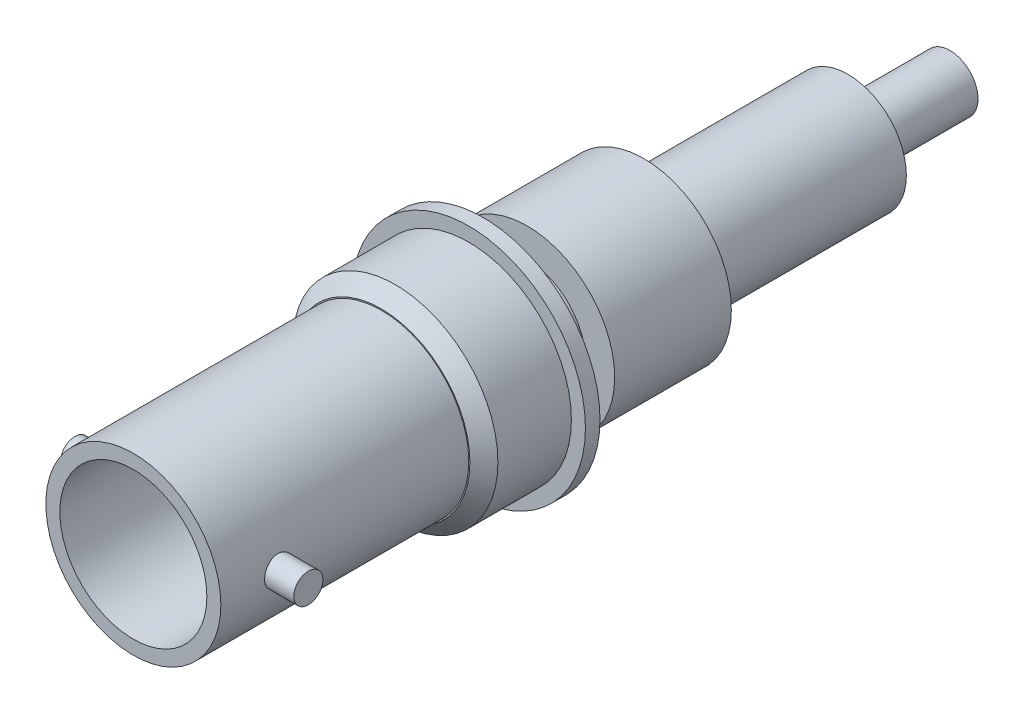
ISO-10303-21;
HEADER;
FILE_DESCRIPTION(('STEP AP214'),'2;1');
FILE_NAME('part.step','',(''),(''),'','','');
FILE_SCHEMA(('AUTOMOTIVE_DESIGN { 1 0 10303 214 1 1 1 1 }'));
ENDSEC;
DATA;
#1=APPLICATION_CONTEXT('core data for automotive mechanical design processes');
#2=APPLICATION_PROTOCOL_DEFINITION('international standard','automotive_design',2000,#1);
#3=PRODUCT_CONTEXT('',#1,'mechanical');
#4=PRODUCT('Part','Part','',(#3));
#5=PRODUCT_RELATED_PRODUCT_CATEGORY('part','',(#4));
#6=PRODUCT_DEFINITION_FORMATION('','',#4);
#7=PRODUCT_DEFINITION_CONTEXT('part definition',#1,'design');
#8=PRODUCT_DEFINITION('design','',#6,#7);
#9=PRODUCT_DEFINITION_SHAPE('','',#8);
#10=(LENGTH_UNIT() NAMED_UNIT(*) SI_UNIT(.MILLI.,.METRE.));
#11=(NAMED_UNIT(*) PLANE_ANGLE_UNIT() SI_UNIT($,.RADIAN.));
#12=(NAMED_UNIT(*) SI_UNIT($,.STERADIAN.) SOLID_ANGLE_UNIT());
#13=UNCERTAINTY_MEASURE_WITH_UNIT(LENGTH_MEASURE(1.E-05),#10,'distance_accuracy_value','');
#14=(GEOMETRIC_REPRESENTATION_CONTEXT(3) GLOBAL_UNCERTAINTY_ASSIGNED_CONTEXT((#13)) GLOBAL_UNIT_ASSIGNED_CONTEXT((#10,
#11,#12)) REPRESENTATION_CONTEXT('',''));
#15=CARTESIAN_POINT('',(0.,0.,0.));
#16=DIRECTION('',(0.,0.,1.));
#17=DIRECTION('',(1.,0.,0.));
#18=AXIS2_PLACEMENT_3D('',#15,#16,#17);
#19=CARTESIAN_POINT('',(0.,0.,0.79375000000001));
#20=DIRECTION('',(0.,0.,1.));
#21=DIRECTION('',(1.00000000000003,0.,0.));
#22=AXIS2_PLACEMENT_3D('',#19,#20,#21);
#23=PLANE('',#22);
#24=CARTESIAN_POINT('',(0.,0.,0.79375000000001));
#25=DIRECTION('',(0.,0.,1.));
#26=DIRECTION('',(1.00000000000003,0.,0.));
#27=AXIS2_PLACEMENT_3D('',#24,#25,#26);
#28=CIRCLE('',#27,6.35);
#29=CARTESIAN_POINT('',(6.35000000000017,0.,0.79375000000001));
#30=VERTEX_POINT('',#29);
#31=EDGE_CURVE('E54',#30,#30,#28,.T.);
#32=ORIENTED_EDGE('',*,*,#31,.T.);
#33=EDGE_LOOP('',(#32));
#34=FACE_BOUND('',#33,.T.);
#35=CARTESIAN_POINT('',(0.,0.,0.79375000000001));
#36=DIRECTION('',(0.,0.,1.));
#37=DIRECTION('',(1.00000000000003,0.,0.));
#38=AXIS2_PLACEMENT_3D('',#35,#36,#37);
#39=CIRCLE('',#38,5.588);
#40=CARTESIAN_POINT('',(-5.58800000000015,0.,0.793750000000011));
#41=VERTEX_POINT('',#40);
#42=EDGE_CURVE('E113',#41,#41,#39,.T.);
#43=ORIENTED_EDGE('',*,*,#42,.F.);
#44=EDGE_LOOP('',(#43));
#45=FACE_BOUND('',#44,.T.);
#46=ADVANCED_FACE('F36',(#34,#45),#23,.T.);
#47=CARTESIAN_POINT('',(0.,0.,19.05));
#48=DIRECTION('',(0.,0.,-1.));
#49=DIRECTION('',(-1.00000000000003,0.,0.));
#50=AXIS2_PLACEMENT_3D('',#47,#48,#49);
#51=CYLINDRICAL_SURFACE('',#50,4.7625);
#52=CARTESIAN_POINT('',(0.,0.,5.55625000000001));
#53=DIRECTION('',(0.,0.,1.));
#54=DIRECTION('',(1.00000000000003,0.,0.));
#55=AXIS2_PLACEMENT_3D('',#52,#53,#54);
#56=CIRCLE('',#55,4.7625);
#57=CARTESIAN_POINT('',(4.76250000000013,0.,5.55625000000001));
#58=VERTEX_POINT('',#57);
#59=EDGE_CURVE('E115',#58,#58,#56,.T.);
#60=ORIENTED_EDGE('',*,*,#59,.T.);
#61=EDGE_LOOP('',(#60));
#62=FACE_BOUND('',#61,.T.);
#63=CARTESIAN_POINT('',(4.7625000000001,0.,16.66875));
#64=CARTESIAN_POINT('',(4.76249924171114,-0.0442566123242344,16.668748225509));
#65=CARTESIAN_POINT('',(4.7618766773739,-0.088537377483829,16.6650361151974));
#66=CARTESIAN_POINT('',(4.75945309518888,-0.175856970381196,16.650291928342));
#67=CARTESIAN_POINT('',(4.7576509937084,-0.218894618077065,16.6392531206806));
#68=CARTESIAN_POINT('',(4.75307046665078,-0.302452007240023,16.6101980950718));
#69=CARTESIAN_POINT('',(4.75029283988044,-0.342973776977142,16.5921875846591));
#70=CARTESIAN_POINT('',(4.74406667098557,-0.420415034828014,16.5497153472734));
#71=CARTESIAN_POINT('',(4.74061820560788,-0.457334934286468,16.5252543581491));
#72=CARTESIAN_POINT('',(4.73339578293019,-0.52688255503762,16.470326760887));
#73=CARTESIAN_POINT('',(4.72961929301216,-0.559470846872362,16.439810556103));
#74=CARTESIAN_POINT('',(4.72218584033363,-0.619089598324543,16.3737455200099));
#75=CARTESIAN_POINT('',(4.71852888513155,-0.646119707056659,16.3381963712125));
#76=CARTESIAN_POINT('',(4.71172402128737,-0.694012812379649,16.2628037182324));
#77=CARTESIAN_POINT('',(4.70857938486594,-0.714836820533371,16.2229351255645));
#78=CARTESIAN_POINT('',(4.7031903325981,-0.749477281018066,16.1402047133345));
#79=CARTESIAN_POINT('',(4.70094585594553,-0.763294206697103,16.0973430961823));
#80=CARTESIAN_POINT('',(4.69763645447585,-0.783404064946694,16.010261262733));
#81=CARTESIAN_POINT('',(4.69656086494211,-0.789765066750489,15.9660571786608));
#82=CARTESIAN_POINT('',(4.69567875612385,-0.794993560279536,15.8771970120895));
#83=CARTESIAN_POINT('',(4.69587214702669,-0.793861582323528,15.8325409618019));
#84=CARTESIAN_POINT('',(4.69749641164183,-0.784191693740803,15.7445304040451));
#85=CARTESIAN_POINT('',(4.69891450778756,-0.775730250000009,15.7011672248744));
#86=CARTESIAN_POINT('',(4.70280839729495,-0.751761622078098,15.6164847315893));
#87=CARTESIAN_POINT('',(4.7052842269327,-0.73625419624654,15.5751654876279));
#88=CARTESIAN_POINT('',(4.71102842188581,-0.698556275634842,15.4955148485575));
#89=CARTESIAN_POINT('',(4.71430053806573,-0.676334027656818,15.4571987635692));
#90=CARTESIAN_POINT('',(4.72126601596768,-0.625859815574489,15.3848103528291));
#91=CARTESIAN_POINT('',(4.72495941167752,-0.597607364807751,15.3507383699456));
#92=CARTESIAN_POINT('',(4.73240743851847,-0.535458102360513,15.2873627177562));
#93=CARTESIAN_POINT('',(4.73616226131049,-0.50149568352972,15.2581233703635));
#94=CARTESIAN_POINT('',(4.7432677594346,-0.429112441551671,15.2057488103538));
#95=CARTESIAN_POINT('',(4.7466184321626,-0.390691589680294,15.1826136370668));
#96=CARTESIAN_POINT('',(4.75254285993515,-0.310421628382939,15.1430982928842));
#97=CARTESIAN_POINT('',(4.75511596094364,-0.268569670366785,15.1267238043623));
#98=CARTESIAN_POINT('',(4.75919007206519,-0.182657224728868,15.1012543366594));
#99=CARTESIAN_POINT('',(4.76069117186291,-0.138596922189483,15.0921587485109));
#100=CARTESIAN_POINT('',(4.76244008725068,-0.050072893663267,15.0815924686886));
#101=CARTESIAN_POINT('',(4.76270241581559,-0.00561998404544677,15.0800334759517));
#102=CARTESIAN_POINT('',(4.76198398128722,0.0829118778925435,15.0843492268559));
#103=CARTESIAN_POINT('',(4.76100326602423,0.126990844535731,15.0902236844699));
#104=CARTESIAN_POINT('',(4.75791792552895,0.213250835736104,15.109166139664));
#105=CARTESIAN_POINT('',(4.75582013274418,0.255441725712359,15.1221904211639));
#106=CARTESIAN_POINT('',(4.75073492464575,0.337041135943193,15.1550162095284));
#107=CARTESIAN_POINT('',(4.74774745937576,0.376449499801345,15.1748180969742));
#108=CARTESIAN_POINT('',(4.74117833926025,0.451748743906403,15.2208392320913));
#109=CARTESIAN_POINT('',(4.73759166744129,0.487605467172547,15.2471136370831));
#110=CARTESIAN_POINT('',(4.73023713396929,0.554432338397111,15.3052580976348));
#111=CARTESIAN_POINT('',(4.72646925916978,0.585402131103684,15.3371285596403));
#112=CARTESIAN_POINT('',(4.71913005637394,0.641903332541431,15.4059564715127));
#113=CARTESIAN_POINT('',(4.71556116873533,0.667375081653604,15.4429631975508));
#114=CARTESIAN_POINT('',(4.70906960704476,0.711740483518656,15.5207820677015));
#115=CARTESIAN_POINT('',(4.70614691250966,0.73063434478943,15.5615940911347));
#116=CARTESIAN_POINT('',(4.70129696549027,0.761218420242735,15.6456982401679));
#117=CARTESIAN_POINT('',(4.69936561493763,0.772938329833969,15.6889793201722));
#118=CARTESIAN_POINT('',(4.69670675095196,0.788935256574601,15.7769306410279));
#119=CARTESIAN_POINT('',(4.69597913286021,0.79321292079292,15.8216007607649));
#120=CARTESIAN_POINT('',(4.69581462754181,0.794185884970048,15.910466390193));
#121=CARTESIAN_POINT('',(4.69636175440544,0.790975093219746,15.9546608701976));
#122=CARTESIAN_POINT('',(4.69865005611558,0.777265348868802,16.0418714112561));
#123=CARTESIAN_POINT('',(4.70039122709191,0.766766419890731,16.084887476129));
#124=CARTESIAN_POINT('',(4.70486535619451,0.738814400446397,16.1684838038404));
#125=CARTESIAN_POINT('',(4.70759716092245,0.721369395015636,16.2090668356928));
#126=CARTESIAN_POINT('',(4.71374587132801,0.680030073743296,16.2867453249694));
#127=CARTESIAN_POINT('',(4.71716281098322,0.656135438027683,16.3238406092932));
#128=CARTESIAN_POINT('',(4.7243474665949,0.602239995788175,16.3939650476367));
#129=CARTESIAN_POINT('',(4.72811886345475,0.572170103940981,16.4269407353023));
#130=CARTESIAN_POINT('',(4.73555813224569,0.506923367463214,16.4874103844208));
#131=CARTESIAN_POINT('',(4.73922598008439,0.471745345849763,16.5149030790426));
#132=CARTESIAN_POINT('',(4.74607423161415,0.396992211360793,16.5637998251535));
#133=CARTESIAN_POINT('',(4.7492510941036,0.357388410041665,16.5851605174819));
#134=CARTESIAN_POINT('',(4.75472495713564,0.275117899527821,16.6208930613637));
#135=CARTESIAN_POINT('',(4.75702283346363,0.232454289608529,16.6352718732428));
#136=CARTESIAN_POINT('',(4.75997838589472,0.158020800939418,16.6535116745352));
#137=CARTESIAN_POINT('',(4.76091893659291,0.126701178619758,16.6592168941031));
#138=CARTESIAN_POINT('',(4.76218001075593,0.0635918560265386,16.6668366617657));
#139=CARTESIAN_POINT('',(4.76250054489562,0.0318021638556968,16.6687512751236));
#140=CARTESIAN_POINT('',(4.7625000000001,0.,16.66875));
#141=B_SPLINE_CURVE_WITH_KNOTS('',3,(#63,#64,#65,#66,#67,#68,#69,#70,#71,#72,#73,#74,#75,#76,
#77,#78,#79,#80,#81,#82,#83,#84,#85,#86,#87,#88,#89,#90,#91,#92,#93,#94,#95,#96,#97,#98,#99,
#100,#101,#102,#103,#104,#105,#106,#107,#108,#109,#110,#111,#112,#113,#114,#115,#116,#117,#118,
#119,#120,#121,#122,#123,#124,#125,#126,#127,#128,#129,#130,#131,#132,#133,#134,#135,#136,#137,
#138,#139,#140),.UNSPECIFIED.,.T.,.F.,(4,2,2,2,2,2,2,2,2,2,2,2,2,2,2,2,2,2,2,2,2,2,2,2,2,2,2,2,
2,2,2,2,2,2,2,2,2,2,4),(0.,0.132653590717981,0.265429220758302,0.398096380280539,
0.530748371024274,0.664535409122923,0.798330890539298,0.932950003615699,1.06756002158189,
1.20093129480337,1.3342931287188,1.46628015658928,1.59827171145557,1.73089746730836,
1.86353393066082,1.99781404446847,2.13209502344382,2.26648863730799,2.40087100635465,
2.53367503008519,2.66647394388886,2.79846978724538,2.93047304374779,3.06364267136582,
3.19682197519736,3.3313808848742,3.46593552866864,3.59992937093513,3.7339115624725,
3.86622261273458,3.99853323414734,4.13069029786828,4.26285391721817,4.39658564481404,
4.53034823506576,4.66503458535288,4.799586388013,4.89491098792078,4.99023394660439),.UNSPECIFIED.);
#142=CARTESIAN_POINT('',(4.7625000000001,0.,16.66875));
#143=VERTEX_POINT('',#142);
#144=EDGE_CURVE('E51',#143,#143,#141,.T.);
#145=ORIENTED_EDGE('',*,*,#144,.F.);
#146=EDGE_LOOP('',(#145));
#147=FACE_BOUND('',#146,.T.);
#148=CARTESIAN_POINT('',(0.,0.,19.05));
#149=DIRECTION('',(0.,0.,1.));
#150=DIRECTION('',(1.00000000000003,0.,0.));
#151=AXIS2_PLACEMENT_3D('',#148,#149,#150);
#152=CIRCLE('',#151,4.7625);
#153=CARTESIAN_POINT('',(4.76250000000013,0.,19.05));
#154=VERTEX_POINT('',#153);
#155=EDGE_CURVE('E60',#154,#154,#152,.T.);
#156=ORIENTED_EDGE('',*,*,#155,.F.);
#157=EDGE_LOOP('',(#156));
#158=FACE_BOUND('',#157,.T.);
#159=CARTESIAN_POINT('',(-4.76250000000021,0.,16.66875));
#160=CARTESIAN_POINT('',(-4.76249924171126,0.0442566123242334,16.668748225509));
#161=CARTESIAN_POINT('',(-4.76187667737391,0.0885373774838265,16.6650361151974));
#162=CARTESIAN_POINT('',(-4.75945309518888,0.175856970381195,16.650291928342));
#163=CARTESIAN_POINT('',(-4.7576509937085,0.218894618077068,16.6392531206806));
#164=CARTESIAN_POINT('',(-4.75307046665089,0.302452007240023,16.6101980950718));
#165=CARTESIAN_POINT('',(-4.75029283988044,0.342973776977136,16.5921875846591));
#166=CARTESIAN_POINT('',(-4.74406667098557,0.420415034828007,16.5497153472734));
#167=CARTESIAN_POINT('',(-4.74061820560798,0.457334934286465,16.5252543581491));
#168=CARTESIAN_POINT('',(-4.7333957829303,0.526882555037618,16.470326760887));
#169=CARTESIAN_POINT('',(-4.72961929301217,0.559470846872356,16.439810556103));
#170=CARTESIAN_POINT('',(-4.72218584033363,0.619089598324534,16.3737455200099));
#171=CARTESIAN_POINT('',(-4.71852888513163,0.646119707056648,16.3381963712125));
#172=CARTESIAN_POINT('',(-4.71172402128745,0.694012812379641,16.2628037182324));
#173=CARTESIAN_POINT('',(-4.70857938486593,0.714836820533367,16.2229351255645));
#174=CARTESIAN_POINT('',(-4.70319033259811,0.749477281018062,16.1402047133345));
#175=CARTESIAN_POINT('',(-4.70094585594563,0.763294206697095,16.0973430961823));
#176=CARTESIAN_POINT('',(-4.69763645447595,0.783404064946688,16.010261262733));
#177=CARTESIAN_POINT('',(-4.69656086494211,0.789765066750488,15.9660571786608));
#178=CARTESIAN_POINT('',(-4.69567875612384,0.794993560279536,15.8771970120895));
#179=CARTESIAN_POINT('',(-4.69587214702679,0.793861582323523,15.8325409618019));
#180=CARTESIAN_POINT('',(-4.69749641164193,0.784191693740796,15.7445304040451));
#181=CARTESIAN_POINT('',(-4.69891450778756,0.775730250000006,15.7011672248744));
#182=CARTESIAN_POINT('',(-4.70280839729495,0.751761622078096,15.6164847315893));
#183=CARTESIAN_POINT('',(-4.70528422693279,0.736254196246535,15.5751654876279));
#184=CARTESIAN_POINT('',(-4.71102842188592,0.698556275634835,15.4955148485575));
#185=CARTESIAN_POINT('',(-4.71430053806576,0.676334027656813,15.4571987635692));
#186=CARTESIAN_POINT('',(-4.72126601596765,0.625859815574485,15.3848103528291));
#187=CARTESIAN_POINT('',(-4.72495941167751,0.597607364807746,15.3507383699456));
#188=CARTESIAN_POINT('',(-4.73240743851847,0.53545810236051,15.2873627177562));
#189=CARTESIAN_POINT('',(-4.73616226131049,0.501495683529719,15.2581233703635));
#190=CARTESIAN_POINT('',(-4.7432677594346,0.429112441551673,15.2057488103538));
#191=CARTESIAN_POINT('',(-4.7466184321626,0.390691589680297,15.1826136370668));
#192=CARTESIAN_POINT('',(-4.75254285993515,0.310421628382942,15.1430982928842));
#193=CARTESIAN_POINT('',(-4.75511596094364,0.268569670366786,15.1267238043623));
#194=CARTESIAN_POINT('',(-4.75919007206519,0.182657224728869,15.1012543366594));
#195=CARTESIAN_POINT('',(-4.76069117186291,0.138596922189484,15.0921587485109));
#196=CARTESIAN_POINT('',(-4.76244008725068,0.050072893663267,15.0815924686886));
#197=CARTESIAN_POINT('',(-4.76270241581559,0.00561998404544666,15.0800334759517));
#198=CARTESIAN_POINT('',(-4.76198398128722,-0.0829118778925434,15.0843492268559));
#199=CARTESIAN_POINT('',(-4.76100326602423,-0.12699084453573,15.0902236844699));
#200=CARTESIAN_POINT('',(-4.75791792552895,-0.213250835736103,15.109166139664));
#201=CARTESIAN_POINT('',(-4.75582013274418,-0.255441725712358,15.1221904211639));
#202=CARTESIAN_POINT('',(-4.75073492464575,-0.337041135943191,15.1550162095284));
#203=CARTESIAN_POINT('',(-4.74774745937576,-0.376449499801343,15.1748180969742));
#204=CARTESIAN_POINT('',(-4.74117833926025,-0.451748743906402,15.2208392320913));
#205=CARTESIAN_POINT('',(-4.73759166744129,-0.487605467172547,15.2471136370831));
#206=CARTESIAN_POINT('',(-4.73023713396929,-0.554432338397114,15.3052580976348));
#207=CARTESIAN_POINT('',(-4.72646925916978,-0.585402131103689,15.3371285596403));
#208=CARTESIAN_POINT('',(-4.71913005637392,-0.641903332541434,15.4059564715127));
#209=CARTESIAN_POINT('',(-4.7155611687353,-0.667375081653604,15.4429631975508));
#210=CARTESIAN_POINT('',(-4.70906960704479,-0.711740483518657,15.5207820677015));
#211=CARTESIAN_POINT('',(-4.70614691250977,-0.730634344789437,15.5615940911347));
#212=CARTESIAN_POINT('',(-4.70129696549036,-0.761218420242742,15.6456982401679));
#213=CARTESIAN_POINT('',(-4.69936561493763,-0.772938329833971,15.6889793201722));
#214=CARTESIAN_POINT('',(-4.69670675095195,-0.788935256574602,15.7769306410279));
#215=CARTESIAN_POINT('',(-4.69597913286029,-0.793212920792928,15.8216007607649));
#216=CARTESIAN_POINT('',(-4.69581462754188,-0.794185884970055,15.910466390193));
#217=CARTESIAN_POINT('',(-4.69636175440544,-0.790975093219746,15.9546608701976));
#218=CARTESIAN_POINT('',(-4.69865005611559,-0.777265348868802,16.0418714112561));
#219=CARTESIAN_POINT('',(-4.70039122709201,-0.766766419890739,16.084887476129));
#220=CARTESIAN_POINT('',(-4.70486535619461,-0.738814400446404,16.1684838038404));
#221=CARTESIAN_POINT('',(-4.70759716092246,-0.721369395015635,16.2090668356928));
#222=CARTESIAN_POINT('',(-4.71374587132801,-0.680030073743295,16.2867453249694));
#223=CARTESIAN_POINT('',(-4.71716281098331,-0.656135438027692,16.3238406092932));
#224=CARTESIAN_POINT('',(-4.72434746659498,-0.602239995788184,16.3939650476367));
#225=CARTESIAN_POINT('',(-4.72811886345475,-0.57217010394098,16.4269407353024));
#226=CARTESIAN_POINT('',(-4.73555813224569,-0.50692336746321,16.4874103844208));
#227=CARTESIAN_POINT('',(-4.73922598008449,-0.471745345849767,16.5149030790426));
#228=CARTESIAN_POINT('',(-4.74607423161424,-0.396992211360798,16.5637998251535));
#229=CARTESIAN_POINT('',(-4.74925109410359,-0.357388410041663,16.5851605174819));
#230=CARTESIAN_POINT('',(-4.75472495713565,-0.275117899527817,16.6208930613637));
#231=CARTESIAN_POINT('',(-4.75702283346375,-0.23245428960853,16.6352718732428));
#232=CARTESIAN_POINT('',(-4.75997838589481,-0.158020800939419,16.6535116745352));
#233=CARTESIAN_POINT('',(-4.76091893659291,-0.126701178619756,16.6592168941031));
#234=CARTESIAN_POINT('',(-4.76218001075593,-0.063591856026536,16.6668366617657));
#235=CARTESIAN_POINT('',(-4.76250054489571,-0.0318021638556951,16.6687512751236));
#236=CARTESIAN_POINT('',(-4.76250000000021,0.,16.66875));
#237=B_SPLINE_CURVE_WITH_KNOTS('',3,(#159,#160,#161,#162,#163,#164,#165,#166,#167,#168,#169,
#170,#171,#172,#173,#174,#175,#176,#177,#178,#179,#180,#181,#182,#183,#184,#185,#186,#187,#188,
#189,#190,#191,#192,#193,#194,#195,#196,#197,#198,#199,#200,#201,#202,#203,#204,#205,#206,#207,
#208,#209,#210,#211,#212,#213,#214,#215,#216,#217,#218,#219,#220,#221,#222,#223,#224,#225,#226,
#227,#228,#229,#230,#231,#232,#233,#234,#235,#236),.UNSPECIFIED.,.T.,.F.,(4,2,2,2,2,2,2,2,2,2,2,
2,2,2,2,2,2,2,2,2,2,2,2,2,2,2,2,2,2,2,2,2,2,2,2,2,2,2,4),(0.,0.13265359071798,0.2654292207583,
0.398096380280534,0.530748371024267,0.664535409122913,0.79833089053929,0.932950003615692,
1.06756002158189,1.20093129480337,1.33429312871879,1.46628015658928,1.59827171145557,
1.73089746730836,1.86353393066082,1.99781404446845,2.13209502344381,2.26648863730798,
2.40087100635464,2.53367503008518,2.66647394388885,2.79846978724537,2.93047304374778,
3.06364267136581,3.19682197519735,3.33138088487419,3.46593552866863,3.59992937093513,
3.73391156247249,3.86622261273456,3.99853323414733,4.13069029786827,4.26285391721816,
4.39658564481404,4.53034823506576,4.66503458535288,4.799586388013,4.89491098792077,
4.99023394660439),.UNSPECIFIED.);
#238=CARTESIAN_POINT('',(-4.76250000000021,0.,16.66875));
#239=VERTEX_POINT('',#238);
#240=EDGE_CURVE('E47',#239,#239,#237,.T.);
#241=ORIENTED_EDGE('',*,*,#240,.F.);
#242=EDGE_LOOP('',(#241));
#243=FACE_BOUND('',#242,.T.);
#244=ADVANCED_FACE('F74',(#62,#147,#158,#243),#51,.T.);
#245=CARTESIAN_POINT('',(0.,0.,19.05));
#246=DIRECTION('',(0.,0.,-1.));
#247=DIRECTION('',(-1.00000000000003,0.,0.));
#248=AXIS2_PLACEMENT_3D('',#245,#246,#247);
#249=CYLINDRICAL_SURFACE('',#248,4.0005);
#250=CARTESIAN_POINT('',(0.,0.,19.05));
#251=DIRECTION('',(0.,0.,1.));
#252=DIRECTION('',(1.00000000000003,0.,0.));
#253=AXIS2_PLACEMENT_3D('',#250,#251,#252);
#254=CIRCLE('',#253,4.0005);
#255=CARTESIAN_POINT('',(4.00050000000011,0.,19.05));
#256=VERTEX_POINT('',#255);
#257=EDGE_CURVE('E63',#256,#256,#254,.T.);
#258=ORIENTED_EDGE('',*,*,#257,.T.);
#259=EDGE_LOOP('',(#258));
#260=FACE_BOUND('',#259,.T.);
#261=CARTESIAN_POINT('',(0.,0.,0.));
#262=DIRECTION('',(0.,0.,1.));
#263=DIRECTION('',(1.00000000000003,0.,0.));
#264=AXIS2_PLACEMENT_3D('',#261,#262,#263);
#265=CIRCLE('',#264,4.0005);
#266=CARTESIAN_POINT('',(4.00050000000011,0.,0.));
#267=VERTEX_POINT('',#266);
#268=EDGE_CURVE('E119',#267,#267,#265,.T.);
#269=ORIENTED_EDGE('',*,*,#268,.F.);
#270=EDGE_LOOP('',(#269));
#271=FACE_BOUND('',#270,.T.);
#272=ADVANCED_FACE('F88',(#260,#271),#249,.F.);
#273=CARTESIAN_POINT('',(0.,0.,0.79375000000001));
#274=DIRECTION('',(0.,0.,-1.));
#275=DIRECTION('',(-1.00000000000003,0.,0.));
#276=AXIS2_PLACEMENT_3D('',#273,#274,#275);
#277=CYLINDRICAL_SURFACE('',#276,6.35);
#278=ORIENTED_EDGE('',*,*,#31,.F.);
#279=EDGE_LOOP('',(#278));
#280=FACE_BOUND('',#279,.T.);
#281=CARTESIAN_POINT('',(0.,0.,0.));
#282=DIRECTION('',(0.,0.,1.));
#283=DIRECTION('',(1.00000000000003,0.,0.));
#284=AXIS2_PLACEMENT_3D('',#281,#282,#283);
#285=CIRCLE('',#284,6.35);
#286=CARTESIAN_POINT('',(6.35000000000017,0.,0.));
#287=VERTEX_POINT('',#286);
#288=EDGE_CURVE('E57',#287,#287,#285,.T.);
#289=ORIENTED_EDGE('',*,*,#288,.T.);
#290=EDGE_LOOP('',(#289));
#291=FACE_BOUND('',#290,.T.);
#292=ADVANCED_FACE('F38',(#280,#291),#277,.T.);
#293=CARTESIAN_POINT('',(0.,0.,0.));
#294=DIRECTION('',(0.,0.,1.));
#295=DIRECTION('',(1.00000000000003,0.,0.));
#296=AXIS2_PLACEMENT_3D('',#293,#294,#295);
#297=PLANE('',#296);
#298=CARTESIAN_POINT('',(0.,0.,0.));
#299=DIRECTION('',(0.,0.,1.));
#300=DIRECTION('',(1.00000000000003,0.,0.));
#301=AXIS2_PLACEMENT_3D('',#298,#299,#300);
#302=CIRCLE('',#301,4.7625);
#303=CARTESIAN_POINT('',(4.76250000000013,0.,0.));
#304=VERTEX_POINT('',#303);
#305=EDGE_CURVE('E375',#304,#304,#302,.T.);
#306=ORIENTED_EDGE('',*,*,#305,.T.);
#307=EDGE_LOOP('',(#306));
#308=FACE_BOUND('',#307,.T.);
#309=ORIENTED_EDGE('',*,*,#288,.F.);
#310=EDGE_LOOP('',(#309));
#311=FACE_BOUND('',#310,.T.);
#312=ADVANCED_FACE('F94',(#308,#311),#297,.F.);
#313=CARTESIAN_POINT('',(0.,0.,19.05));
#314=DIRECTION('',(0.,0.,1.));
#315=DIRECTION('',(1.00000000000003,0.,0.));
#316=AXIS2_PLACEMENT_3D('',#313,#314,#315);
#317=PLANE('',#316);
#318=ORIENTED_EDGE('',*,*,#155,.T.);
#319=EDGE_LOOP('',(#318));
#320=FACE_BOUND('',#319,.T.);
#321=ORIENTED_EDGE('',*,*,#257,.F.);
#322=EDGE_LOOP('',(#321));
#323=FACE_BOUND('',#322,.T.);
#324=ADVANCED_FACE('F92',(#320,#323),#317,.T.);
#325=CARTESIAN_POINT('',(6.3500000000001,0.,15.875));
#326=DIRECTION('',(1.00000000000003,0.,0.));
#327=DIRECTION('',(0.,0.,-1.));
#328=AXIS2_PLACEMENT_3D('',#325,#326,#327);
#329=PLANE('',#328);
#330=CARTESIAN_POINT('',(6.3500000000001,0.,15.875));
#331=DIRECTION('',(1.00000000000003,0.,0.));
#332=DIRECTION('',(0.,0.,-1.));
#333=AXIS2_PLACEMENT_3D('',#330,#331,#332);
#334=CIRCLE('',#333,0.793749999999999);
#335=CARTESIAN_POINT('',(6.3500000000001,0.,15.08125));
#336=VERTEX_POINT('',#335);
#337=EDGE_CURVE('E65',#336,#336,#334,.T.);
#338=ORIENTED_EDGE('',*,*,#337,.T.);
#339=EDGE_LOOP('',(#338));
#340=FACE_BOUND('',#339,.T.);
#341=ADVANCED_FACE('F86',(#340),#329,.T.);
#342=CARTESIAN_POINT('',(6.3500000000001,0.,15.875));
#343=DIRECTION('',(-1.00000000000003,0.,0.));
#344=DIRECTION('',(0.,0.,1.));
#345=AXIS2_PLACEMENT_3D('',#342,#343,#344);
#346=CYLINDRICAL_SURFACE('',#345,0.793749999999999);
#347=ORIENTED_EDGE('',*,*,#337,.F.);
#348=EDGE_LOOP('',(#347));
#349=FACE_BOUND('',#348,.T.);
#350=ORIENTED_EDGE('',*,*,#144,.T.);
#351=EDGE_LOOP('',(#350));
#352=FACE_BOUND('',#351,.T.);
#353=ADVANCED_FACE('F84',(#349,#352),#346,.T.);
#354=CARTESIAN_POINT('',(-6.35000000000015,0.,15.875));
#355=DIRECTION('',(1.00000000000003,0.,0.));
#356=DIRECTION('',(0.,0.,-1.));
#357=AXIS2_PLACEMENT_3D('',#354,#355,#356);
#358=CIRCLE('',#357,0.793749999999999);
#359=CARTESIAN_POINT('',(-6.35000000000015,0.,15.08125));
#360=VERTEX_POINT('',#359);
#361=EDGE_CURVE('E128',#360,#360,#358,.T.);
#362=ORIENTED_EDGE('',*,*,#361,.T.);
#363=EDGE_LOOP('',(#362));
#364=FACE_BOUND('',#363,.T.);
#365=ORIENTED_EDGE('',*,*,#240,.T.);
#366=EDGE_LOOP('',(#365));
#367=FACE_BOUND('',#366,.T.);
#368=ADVANCED_FACE('F78',(#364,#367),#346,.T.);
#369=CARTESIAN_POINT('',(-6.35000000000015,0.,15.875));
#370=DIRECTION('',(1.00000000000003,0.,0.));
#371=DIRECTION('',(0.,0.,-1.));
#372=AXIS2_PLACEMENT_3D('',#369,#370,#371);
#373=PLANE('',#372);
#374=ORIENTED_EDGE('',*,*,#361,.F.);
#375=EDGE_LOOP('',(#374));
#376=FACE_BOUND('',#375,.T.);
#377=ADVANCED_FACE('F83',(#376),#373,.F.);
#378=CARTESIAN_POINT('',(0.,0.,5.55625000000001));
#379=DIRECTION('',(0.,0.,1.));
#380=DIRECTION('',(1.00000000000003,0.,0.));
#381=AXIS2_PLACEMENT_3D('',#378,#379,#380);
#382=PLANE('',#381);
#383=CARTESIAN_POINT('',(0.,0.,5.55625000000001));
#384=DIRECTION('',(0.,0.,1.));
#385=DIRECTION('',(1.00000000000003,0.,0.));
#386=AXIS2_PLACEMENT_3D('',#383,#384,#385);
#387=CIRCLE('',#386,4.82600000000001);
#388=CARTESIAN_POINT('',(4.82600000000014,0.,5.55625000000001));
#389=VERTEX_POINT('',#388);
#390=EDGE_CURVE('E43',#389,#389,#387,.T.);
#391=ORIENTED_EDGE('',*,*,#390,.T.);
#392=EDGE_LOOP('',(#391));
#393=FACE_BOUND('',#392,.T.);
#394=ORIENTED_EDGE('',*,*,#59,.F.);
#395=EDGE_LOOP('',(#394));
#396=FACE_BOUND('',#395,.T.);
#397=ADVANCED_FACE('F157',(#393,#396),#382,.T.);
#398=CARTESIAN_POINT('',(0.,0.,5.55625000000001));
#399=DIRECTION('',(0.,0.,-1.));
#400=DIRECTION('',(-1.00000000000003,0.,0.));
#401=AXIS2_PLACEMENT_3D('',#398,#399,#400);
#402=CYLINDRICAL_SURFACE('',#401,5.588);
#403=CARTESIAN_POINT('',(0.,0.,4.79425000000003));
#404=DIRECTION('',(0.,0.,1.));
#405=DIRECTION('',(1.00000000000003,0.,0.));
#406=AXIS2_PLACEMENT_3D('',#403,#404,#405);
#407=CIRCLE('',#406,5.588);
#408=CARTESIAN_POINT('',(-5.58800000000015,0.,4.79425000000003));
#409=VERTEX_POINT('',#408);
#410=EDGE_CURVE('E11',#409,#409,#407,.F.);
#411=CARTESIAN_POINT('',(-5.58800000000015,0.,4.79425000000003));
#412=CARTESIAN_POINT('',(-5.58800000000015,0.,4.75257812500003));
#413=CARTESIAN_POINT('',(-5.58800000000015,0.,4.71090625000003));
#414=CARTESIAN_POINT('',(-5.58800000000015,0.,4.62756250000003));
#415=CARTESIAN_POINT('',(-5.58800000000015,0.,4.58589062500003));
#416=CARTESIAN_POINT('',(-5.58800000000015,0.,4.50254687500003));
#417=CARTESIAN_POINT('',(-5.58800000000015,0.,4.46087500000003));
#418=CARTESIAN_POINT('',(-5.58800000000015,0.,4.37753125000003));
#419=CARTESIAN_POINT('',(-5.58800000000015,0.,4.33585937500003));
#420=CARTESIAN_POINT('',(-5.58800000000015,0.,4.25251562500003));
#421=CARTESIAN_POINT('',(-5.58800000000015,0.,4.21084375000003));
#422=CARTESIAN_POINT('',(-5.58800000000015,0.,4.12750000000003));
#423=CARTESIAN_POINT('',(-5.58800000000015,0.,4.08582812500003));
#424=CARTESIAN_POINT('',(-5.58800000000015,0.,4.00248437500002));
#425=CARTESIAN_POINT('',(-5.58800000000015,0.,3.96081250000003));
#426=CARTESIAN_POINT('',(-5.58800000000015,0.,3.87746875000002));
#427=CARTESIAN_POINT('',(-5.58800000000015,0.,3.83579687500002));
#428=CARTESIAN_POINT('',(-5.58800000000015,0.,3.75245312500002));
#429=CARTESIAN_POINT('',(-5.58800000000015,0.,3.71078125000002));
#430=CARTESIAN_POINT('',(-5.58800000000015,0.,3.62743750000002));
#431=CARTESIAN_POINT('',(-5.58800000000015,0.,3.58576562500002));
#432=CARTESIAN_POINT('',(-5.58800000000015,0.,3.50242187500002));
#433=CARTESIAN_POINT('',(-5.58800000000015,0.,3.46075000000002));
#434=CARTESIAN_POINT('',(-5.58800000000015,0.,3.37740625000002));
#435=CARTESIAN_POINT('',(-5.58800000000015,0.,3.33573437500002));
#436=CARTESIAN_POINT('',(-5.58800000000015,0.,3.25239062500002));
#437=CARTESIAN_POINT('',(-5.58800000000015,0.,3.21071875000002));
#438=CARTESIAN_POINT('',(-5.58800000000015,0.,3.12737500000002));
#439=CARTESIAN_POINT('',(-5.58800000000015,0.,3.08570312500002));
#440=CARTESIAN_POINT('',(-5.58800000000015,0.,3.00235937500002));
#441=CARTESIAN_POINT('',(-5.58800000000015,0.,2.96068750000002));
#442=CARTESIAN_POINT('',(-5.58800000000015,0.,2.87734375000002));
#443=CARTESIAN_POINT('',(-5.58800000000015,0.,2.83567187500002));
#444=CARTESIAN_POINT('',(-5.58800000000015,0.,2.75232812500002));
#445=CARTESIAN_POINT('',(-5.58800000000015,0.,2.71065625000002));
#446=CARTESIAN_POINT('',(-5.58800000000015,0.,2.62731250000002));
#447=CARTESIAN_POINT('',(-5.58800000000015,0.,2.58564062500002));
#448=CARTESIAN_POINT('',(-5.58800000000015,0.,2.50229687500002));
#449=CARTESIAN_POINT('',(-5.58800000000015,0.,2.46062500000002));
#450=CARTESIAN_POINT('',(-5.58800000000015,0.,2.37728125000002));
#451=CARTESIAN_POINT('',(-5.58800000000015,0.,2.33560937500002));
#452=CARTESIAN_POINT('',(-5.58800000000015,0.,2.25226562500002));
#453=CARTESIAN_POINT('',(-5.58800000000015,0.,2.21059375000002));
#454=CARTESIAN_POINT('',(-5.58800000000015,0.,2.12725000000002));
#455=CARTESIAN_POINT('',(-5.58800000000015,0.,2.08557812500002));
#456=CARTESIAN_POINT('',(-5.58800000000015,0.,2.00223437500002));
#457=CARTESIAN_POINT('',(-5.58800000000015,0.,1.96056250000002));
#458=CARTESIAN_POINT('',(-5.58800000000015,0.,1.87721875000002));
#459=CARTESIAN_POINT('',(-5.58800000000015,0.,1.83554687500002));
#460=CARTESIAN_POINT('',(-5.58800000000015,0.,1.75220312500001));
#461=CARTESIAN_POINT('',(-5.58800000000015,0.,1.71053125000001));
#462=CARTESIAN_POINT('',(-5.58800000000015,0.,1.62718750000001));
#463=CARTESIAN_POINT('',(-5.58800000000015,0.,1.58551562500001));
#464=CARTESIAN_POINT('',(-5.58800000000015,0.,1.50217187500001));
#465=CARTESIAN_POINT('',(-5.58800000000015,0.,1.46050000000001));
#466=CARTESIAN_POINT('',(-5.58800000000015,0.,1.37715625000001));
#467=CARTESIAN_POINT('',(-5.58800000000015,0.,1.33548437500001));
#468=CARTESIAN_POINT('',(-5.58800000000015,0.,1.25214062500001));
#469=CARTESIAN_POINT('',(-5.58800000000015,0.,1.21046875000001));
#470=CARTESIAN_POINT('',(-5.58800000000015,0.,1.12712500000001));
#471=CARTESIAN_POINT('',(-5.58800000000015,0.,1.08545312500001));
#472=CARTESIAN_POINT('',(-5.58800000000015,0.,1.00210937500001));
#473=CARTESIAN_POINT('',(-5.58800000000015,0.,0.960437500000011));
#474=CARTESIAN_POINT('',(-5.58800000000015,0.,0.877093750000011));
#475=CARTESIAN_POINT('',(-5.58800000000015,0.,0.835421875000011));
#476=CARTESIAN_POINT('',(-5.58800000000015,0.,0.793750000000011));
#477=B_SPLINE_CURVE_WITH_KNOTS('',3,(#411,#412,#413,#414,#415,#416,#417,#418,#419,#420,#421,
#422,#423,#424,#425,#426,#427,#428,#429,#430,#431,#432,#433,#434,#435,#436,#437,#438,#439,#440,
#441,#442,#443,#444,#445,#446,#447,#448,#449,#450,#451,#452,#453,#454,#455,#456,#457,#458,#459,
#460,#461,#462,#463,#464,#465,#466,#467,#468,#469,#470,#471,#472,#473,#474,#475,#476),
.UNSPECIFIED.,.F.,.F.,(4,2,2,2,2,2,2,2,2,2,2,2,2,2,2,2,2,2,2,2,2,2,2,2,2,2,2,2,2,2,2,2,4),(0.,
0.125015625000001,0.250031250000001,0.375046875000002,0.500062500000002,0.625078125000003,
0.750093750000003,0.875109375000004,1.000125,1.12514062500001,1.25015625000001,1.37517187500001,
1.50018750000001,1.62520312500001,1.75021875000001,1.87523437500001,2.00025000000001,
2.12526562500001,2.25028125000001,2.37529687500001,2.50031250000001,2.62532812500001,
2.75034375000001,2.87535937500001,3.00037500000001,3.12539062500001,3.25040625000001,
3.37542187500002,3.50043750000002,3.62545312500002,3.75046875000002,3.87548437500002,
4.00050000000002),.UNSPECIFIED.);
#478=EDGE_CURVE('BSEAM164',#409,#41,#477,.T.);
#479=ORIENTED_EDGE('',*,*,#410,.T.);
#480=ORIENTED_EDGE('',*,*,#42,.T.);
#481=ORIENTED_EDGE('',*,*,#478,.T.);
#482=ORIENTED_EDGE('',*,*,#478,.F.);
#483=EDGE_LOOP('',(#479,#481,#480,#482));
#484=FACE_BOUND('',#483,.T.);
#485=ADVANCED_FACE('F164',(#484),#402,.T.);
#486=CARTESIAN_POINT('',(0.,0.,5.55625000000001));
#487=DIRECTION('',(0.,0.,-1.));
#488=DIRECTION('',(-1.00000000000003,0.,0.));
#489=AXIS2_PLACEMENT_3D('',#486,#487,#488);
#490=CONICAL_SURFACE('',#489,4.82600000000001,0.785398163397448);
#491=ORIENTED_EDGE('',*,*,#410,.F.);
#492=EDGE_LOOP('',(#491));
#493=FACE_BOUND('',#492,.T.);
#494=ORIENTED_EDGE('',*,*,#390,.F.);
#495=EDGE_LOOP('',(#494));
#496=FACE_BOUND('',#495,.T.);
#497=ADVANCED_FACE('F171',(#493,#496),#490,.T.);
#498=CARTESIAN_POINT('',(0.,0.,0.));
#499=DIRECTION('',(0.,0.,1.));
#500=DIRECTION('',(1.00000000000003,0.,0.));
#501=AXIS2_PLACEMENT_3D('',#498,#499,#500);
#502=CYLINDRICAL_SURFACE('',#501,4.7625);
#503=CARTESIAN_POINT('',(0.,0.,-0.812800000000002));
#504=DIRECTION('',(0.,0.,1.));
#505=DIRECTION('',(1.00000000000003,0.,0.));
#506=AXIS2_PLACEMENT_3D('',#503,#504,#505);
#507=CIRCLE('',#506,4.7625);
#508=CARTESIAN_POINT('',(4.76250000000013,0.,-0.812800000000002));
#509=VERTEX_POINT('',#508);
#510=EDGE_CURVE('E372',#509,#509,#507,.T.);
#511=ORIENTED_EDGE('',*,*,#510,.T.);
#512=EDGE_LOOP('',(#511));
#513=FACE_BOUND('',#512,.T.);
#514=ORIENTED_EDGE('',*,*,#305,.F.);
#515=EDGE_LOOP('',(#514));
#516=FACE_BOUND('',#515,.T.);
#517=ADVANCED_FACE('F178',(#513,#516),#502,.T.);
#518=CARTESIAN_POINT('',(3.17500000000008,0.,-0.812800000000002));
#519=DIRECTION('',(0.,0.,-1.));
#520=DIRECTION('',(-1.00000000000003,0.,0.));
#521=AXIS2_PLACEMENT_3D('',#518,#519,#520);
#522=PLANE('',#521);
#523=CARTESIAN_POINT('',(0.,0.,-0.812800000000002));
#524=DIRECTION('',(0.,0.,1.));
#525=DIRECTION('',(1.00000000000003,0.,0.));
#526=AXIS2_PLACEMENT_3D('',#523,#524,#525);
#527=CIRCLE('',#526,3.175);
#528=CARTESIAN_POINT('',(3.17500000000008,0.,-0.812800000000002));
#529=VERTEX_POINT('',#528);
#530=EDGE_CURVE('E369',#529,#529,#527,.T.);
#531=ORIENTED_EDGE('',*,*,#530,.T.);
#532=EDGE_LOOP('',(#531));
#533=FACE_BOUND('',#532,.T.);
#534=ORIENTED_EDGE('',*,*,#510,.F.);
#535=EDGE_LOOP('',(#534));
#536=FACE_BOUND('',#535,.T.);
#537=ADVANCED_FACE('F186',(#533,#536),#522,.T.);
#538=CARTESIAN_POINT('',(0.,0.,0.));
#539=DIRECTION('',(0.,0.,1.));
#540=DIRECTION('',(1.00000000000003,0.,0.));
#541=AXIS2_PLACEMENT_3D('',#538,#539,#540);
#542=CYLINDRICAL_SURFACE('',#541,3.175);
#543=CARTESIAN_POINT('',(0.,0.,-2.38759999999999));
#544=DIRECTION('',(0.,0.,1.));
#545=DIRECTION('',(1.00000000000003,0.,0.));
#546=AXIS2_PLACEMENT_3D('',#543,#544,#545);
#547=CIRCLE('',#546,3.175);
#548=CARTESIAN_POINT('',(3.17500000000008,0.,-2.38759999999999));
#549=VERTEX_POINT('',#548);
#550=EDGE_CURVE('E366',#549,#549,#547,.T.);
#551=ORIENTED_EDGE('',*,*,#550,.T.);
#552=EDGE_LOOP('',(#551));
#553=FACE_BOUND('',#552,.T.);
#554=ORIENTED_EDGE('',*,*,#530,.F.);
#555=EDGE_LOOP('',(#554));
#556=FACE_BOUND('',#555,.T.);
#557=ADVANCED_FACE('F194',(#553,#556),#542,.T.);
#558=CARTESIAN_POINT('',(4.76250000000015,0.,-2.38759999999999));
#559=DIRECTION('',(0.,0.,1.));
#560=DIRECTION('',(1.00000000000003,0.,0.));
#561=AXIS2_PLACEMENT_3D('',#558,#559,#560);
#562=PLANE('',#561);
#563=CARTESIAN_POINT('',(0.,0.,-2.38759999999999));
#564=DIRECTION('',(0.,0.,1.));
#565=DIRECTION('',(1.00000000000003,0.,0.));
#566=AXIS2_PLACEMENT_3D('',#563,#564,#565);
#567=CIRCLE('',#566,4.7625);
#568=CARTESIAN_POINT('',(4.76250000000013,0.,-2.38759999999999));
#569=VERTEX_POINT('',#568);
#570=EDGE_CURVE('E363',#569,#569,#567,.T.);
#571=ORIENTED_EDGE('',*,*,#570,.T.);
#572=EDGE_LOOP('',(#571));
#573=FACE_BOUND('',#572,.T.);
#574=ORIENTED_EDGE('',*,*,#550,.F.);
#575=EDGE_LOOP('',(#574));
#576=FACE_BOUND('',#575,.T.);
#577=ADVANCED_FACE('F202',(#573,#576),#562,.T.);
#578=CARTESIAN_POINT('',(0.,0.,0.));
#579=DIRECTION('',(0.,0.,1.));
#580=DIRECTION('',(1.00000000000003,0.,0.));
#581=AXIS2_PLACEMENT_3D('',#578,#579,#580);
#582=CYLINDRICAL_SURFACE('',#581,4.7625);
#583=CARTESIAN_POINT('',(0.,0.,-8.73760000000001));
#584=DIRECTION('',(0.,0.,1.));
#585=DIRECTION('',(1.00000000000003,0.,0.));
#586=AXIS2_PLACEMENT_3D('',#583,#584,#585);
#587=CIRCLE('',#586,4.7625);
#588=CARTESIAN_POINT('',(4.76250000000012,0.,-8.73760000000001));
#589=VERTEX_POINT('',#588);
#590=EDGE_CURVE('E360',#589,#589,#587,.T.);
#591=ORIENTED_EDGE('',*,*,#590,.T.);
#592=EDGE_LOOP('',(#591));
#593=FACE_BOUND('',#592,.T.);
#594=ORIENTED_EDGE('',*,*,#570,.F.);
#595=EDGE_LOOP('',(#594));
#596=FACE_BOUND('',#595,.T.);
#597=ADVANCED_FACE('F210',(#593,#596),#582,.T.);
#598=CARTESIAN_POINT('',(3.17500000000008,0.,-8.73760000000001));
#599=DIRECTION('',(0.,0.,-1.));
#600=DIRECTION('',(-1.00000000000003,0.,0.));
#601=AXIS2_PLACEMENT_3D('',#598,#599,#600);
#602=PLANE('',#601);
#603=CARTESIAN_POINT('',(0.,0.,-8.73760000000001));
#604=DIRECTION('',(0.,0.,1.));
#605=DIRECTION('',(1.00000000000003,0.,0.));
#606=AXIS2_PLACEMENT_3D('',#603,#604,#605);
#607=CIRCLE('',#606,3.175);
#608=CARTESIAN_POINT('',(3.17500000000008,0.,-8.73760000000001));
#609=VERTEX_POINT('',#608);
#610=EDGE_CURVE('E355',#609,#609,#607,.T.);
#611=ORIENTED_EDGE('',*,*,#610,.T.);
#612=EDGE_LOOP('',(#611));
#613=FACE_BOUND('',#612,.T.);
#614=ORIENTED_EDGE('',*,*,#590,.F.);
#615=EDGE_LOOP('',(#614));
#616=FACE_BOUND('',#615,.T.);
#617=ADVANCED_FACE('F218',(#613,#616),#602,.T.);
#618=CARTESIAN_POINT('',(0.,0.,0.));
#619=DIRECTION('',(0.,0.,1.));
#620=DIRECTION('',(1.00000000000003,0.,0.));
#621=AXIS2_PLACEMENT_3D('',#618,#619,#620);
#622=CYLINDRICAL_SURFACE('',#621,3.175);
#623=CARTESIAN_POINT('',(0.,0.,-19.8501));
#624=DIRECTION('',(0.,0.,1.));
#625=DIRECTION('',(1.00000000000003,0.,0.));
#626=AXIS2_PLACEMENT_3D('',#623,#624,#625);
#627=CIRCLE('',#626,3.175);
#628=CARTESIAN_POINT('',(3.17500000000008,0.,-19.8501));
#629=VERTEX_POINT('',#628);
#630=EDGE_CURVE('E353',#629,#629,#627,.T.);
#631=ORIENTED_EDGE('',*,*,#630,.T.);
#632=EDGE_LOOP('',(#631));
#633=FACE_BOUND('',#632,.T.);
#634=ORIENTED_EDGE('',*,*,#610,.F.);
#635=EDGE_LOOP('',(#634));
#636=FACE_BOUND('',#635,.T.);
#637=ADVANCED_FACE('F226',(#633,#636),#622,.T.);
#638=CARTESIAN_POINT('',(1.52400000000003,0.,-19.8501));
#639=DIRECTION('',(0.,0.,-1.));
#640=DIRECTION('',(-1.00000000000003,0.,0.));
#641=AXIS2_PLACEMENT_3D('',#638,#639,#640);
#642=PLANE('',#641);
#643=CARTESIAN_POINT('',(0.,0.,-19.8501));
#644=DIRECTION('',(0.,0.,1.));
#645=DIRECTION('',(1.00000000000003,0.,0.));
#646=AXIS2_PLACEMENT_3D('',#643,#644,#645);
#647=CIRCLE('',#646,1.524);
#648=CARTESIAN_POINT('',(1.52400000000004,0.,-19.8501));
#649=VERTEX_POINT('',#648);
#650=EDGE_CURVE('E122',#649,#649,#647,.T.);
#651=ORIENTED_EDGE('',*,*,#650,.T.);
#652=EDGE_LOOP('',(#651));
#653=FACE_BOUND('',#652,.T.);
#654=ORIENTED_EDGE('',*,*,#630,.F.);
#655=EDGE_LOOP('',(#654));
#656=FACE_BOUND('',#655,.T.);
#657=ADVANCED_FACE('F234',(#653,#656),#642,.T.);
#658=CARTESIAN_POINT('',(0.,0.,0.));
#659=DIRECTION('',(0.,0.,1.));
#660=DIRECTION('',(1.00000000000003,0.,0.));
#661=AXIS2_PLACEMENT_3D('',#658,#659,#660);
#662=CYLINDRICAL_SURFACE('',#661,1.524);
#663=CARTESIAN_POINT('',(0.,0.,-25.4));
#664=DIRECTION('',(0.,0.,1.));
#665=DIRECTION('',(1.00000000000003,0.,0.));
#666=AXIS2_PLACEMENT_3D('',#663,#664,#665);
#667=CIRCLE('',#666,1.524);
#668=CARTESIAN_POINT('',(1.52400000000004,0.,-25.4));
#669=VERTEX_POINT('',#668);
#670=EDGE_CURVE('E116',#669,#669,#667,.T.);
#671=ORIENTED_EDGE('',*,*,#670,.T.);
#672=EDGE_LOOP('',(#671));
#673=FACE_BOUND('',#672,.T.);
#674=ORIENTED_EDGE('',*,*,#650,.F.);
#675=EDGE_LOOP('',(#674));
#676=FACE_BOUND('',#675,.T.);
#677=ADVANCED_FACE('F242',(#673,#676),#662,.T.);
#678=CARTESIAN_POINT('',(0.,0.,-25.4));
#679=DIRECTION('',(0.,0.,-1.));
#680=DIRECTION('',(-1.00000000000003,0.,0.));
#681=AXIS2_PLACEMENT_3D('',#678,#679,#680);
#682=PLANE('',#681);
#683=ORIENTED_EDGE('',*,*,#670,.F.);
#684=EDGE_LOOP('',(#683));
#685=FACE_BOUND('',#684,.T.);
#686=ADVANCED_FACE('F250',(#685),#682,.T.);
#687=CARTESIAN_POINT('',(4.7625000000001,0.,0.));
#688=DIRECTION('',(0.,0.,1.));
#689=DIRECTION('',(1.00000000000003,0.,0.));
#690=AXIS2_PLACEMENT_3D('',#687,#688,#689);
#691=PLANE('',#690);
#692=ORIENTED_EDGE('',*,*,#268,.T.);
#693=EDGE_LOOP('',(#692));
#694=FACE_BOUND('',#693,.T.);
#695=ADVANCED_FACE('F258',(#694),#691,.T.);
#696=CLOSED_SHELL('',(#46,#244,#272,#292,#312,#324,#341,#353,#368,#377,#397,#485,#497,#517,#537,
#557,#577,#597,#617,#637,#657,#677,#686,#695));
#697=MANIFOLD_SOLID_BREP('B2',#696);
#698=ADVANCED_BREP_SHAPE_REPRESENTATION('',(#18,#697),#14);
#699=SHAPE_DEFINITION_REPRESENTATION(#9,#698);
ENDSEC;
END-ISO-10303-21;
